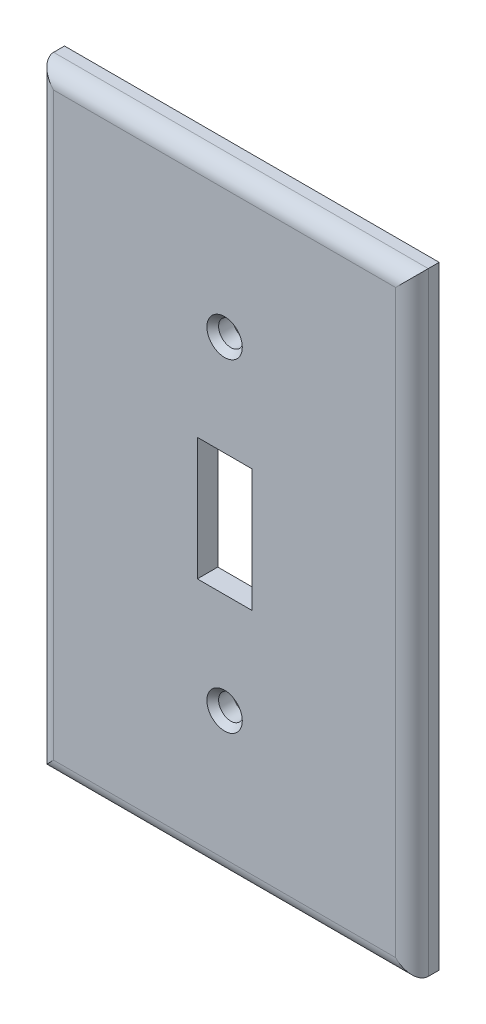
ISO-10303-21;
HEADER;
FILE_DESCRIPTION(('STEP AP214'),'2;1');
FILE_NAME('part.step','',(''),(''),'','','');
FILE_SCHEMA(('AUTOMOTIVE_DESIGN { 1 0 10303 214 1 1 1 1 }'));
ENDSEC;
DATA;
#1=APPLICATION_CONTEXT('core data for automotive mechanical design processes');
#2=APPLICATION_PROTOCOL_DEFINITION('international standard','automotive_design',2000,#1);
#3=PRODUCT_CONTEXT('',#1,'mechanical');
#4=PRODUCT('Part','Part','',(#3));
#5=PRODUCT_RELATED_PRODUCT_CATEGORY('part','',(#4));
#6=PRODUCT_DEFINITION_FORMATION('','',#4);
#7=PRODUCT_DEFINITION_CONTEXT('part definition',#1,'design');
#8=PRODUCT_DEFINITION('design','',#6,#7);
#9=PRODUCT_DEFINITION_SHAPE('','',#8);
#10=(LENGTH_UNIT() NAMED_UNIT(*) SI_UNIT(.MILLI.,.METRE.));
#11=(NAMED_UNIT(*) PLANE_ANGLE_UNIT() SI_UNIT($,.RADIAN.));
#12=(NAMED_UNIT(*) SI_UNIT($,.STERADIAN.) SOLID_ANGLE_UNIT());
#13=UNCERTAINTY_MEASURE_WITH_UNIT(LENGTH_MEASURE(1.E-05),#10,'distance_accuracy_value','');
#14=(GEOMETRIC_REPRESENTATION_CONTEXT(3) GLOBAL_UNCERTAINTY_ASSIGNED_CONTEXT((#13)) GLOBAL_UNIT_ASSIGNED_CONTEXT((#10,
#11,#12)) REPRESENTATION_CONTEXT('',''));
#15=CARTESIAN_POINT('',(0.,0.,0.));
#16=DIRECTION('',(0.,0.,1.));
#17=DIRECTION('',(1.,0.,0.));
#18=AXIS2_PLACEMENT_3D('',#15,#16,#17);
#19=CARTESIAN_POINT('',(-5.08,11.43,5.08));
#20=DIRECTION('',(1.,0.,0.));
#21=DIRECTION('',(0.,0.,-1.));
#22=AXIS2_PLACEMENT_3D('',#19,#20,#21);
#23=PLANE('',#22);
#24=DIRECTION('',(0.,0.,-1.));
#25=VECTOR('',#24,1.);
#26=CARTESIAN_POINT('',(-5.08,-11.43,5.08));
#27=LINE('',#26,#25);
#28=CARTESIAN_POINT('',(-5.08,-11.43,5.08));
#29=VERTEX_POINT('',#28);
#30=CARTESIAN_POINT('',(-5.08,-11.43,1.27));
#31=VERTEX_POINT('',#30);
#32=EDGE_CURVE('E284',#29,#31,#27,.T.);
#33=ORIENTED_EDGE('',*,*,#32,.T.);
#34=DIRECTION('',(0.,1.,0.));
#35=VECTOR('',#34,1.);
#36=CARTESIAN_POINT('',(-5.08,11.43,1.27));
#37=LINE('',#36,#35);
#38=CARTESIAN_POINT('',(-5.08,11.43,1.27));
#39=VERTEX_POINT('',#38);
#40=EDGE_CURVE('E235',#31,#39,#37,.T.);
#41=ORIENTED_EDGE('',*,*,#40,.T.);
#42=DIRECTION('',(0.,0.,-1.));
#43=VECTOR('',#42,1.);
#44=CARTESIAN_POINT('',(-5.08,11.43,5.08));
#45=LINE('',#44,#43);
#46=CARTESIAN_POINT('',(-5.08,11.43,5.08));
#47=VERTEX_POINT('',#46);
#48=EDGE_CURVE('E275',#47,#39,#45,.T.);
#49=ORIENTED_EDGE('',*,*,#48,.F.);
#50=DIRECTION('',(0.,-1.,0.));
#51=VECTOR('',#50,1.);
#52=CARTESIAN_POINT('',(-5.08,11.43,5.08));
#53=LINE('',#52,#51);
#54=EDGE_CURVE('E266',#47,#29,#53,.T.);
#55=ORIENTED_EDGE('',*,*,#54,.T.);
#56=EDGE_LOOP('',(#33,#41,#49,#55));
#57=FACE_BOUND('',#56,.T.);
#58=ADVANCED_FACE('F36',(#57),#23,.T.);
#59=CARTESIAN_POINT('',(-5.08,-11.43,5.08));
#60=DIRECTION('',(0.,1.,0.));
#61=DIRECTION('',(0.,0.,1.));
#62=AXIS2_PLACEMENT_3D('',#59,#60,#61);
#63=PLANE('',#62);
#64=DIRECTION('',(0.,0.,-1.));
#65=VECTOR('',#64,1.);
#66=CARTESIAN_POINT('',(5.08,-11.43,5.08));
#67=LINE('',#66,#65);
#68=CARTESIAN_POINT('',(5.08,-11.43,5.08));
#69=VERTEX_POINT('',#68);
#70=CARTESIAN_POINT('',(5.08,-11.43,1.27));
#71=VERTEX_POINT('',#70);
#72=EDGE_CURVE('E281',#69,#71,#67,.T.);
#73=ORIENTED_EDGE('',*,*,#72,.T.);
#74=DIRECTION('',(-1.,0.,0.));
#75=VECTOR('',#74,1.);
#76=CARTESIAN_POINT('',(-5.08,-11.43,1.27));
#77=LINE('',#76,#75);
#78=EDGE_CURVE('E386',#71,#31,#77,.T.);
#79=ORIENTED_EDGE('',*,*,#78,.T.);
#80=ORIENTED_EDGE('',*,*,#32,.F.);
#81=DIRECTION('',(1.,0.,0.));
#82=VECTOR('',#81,1.);
#83=CARTESIAN_POINT('',(-5.08,-11.43,5.08));
#84=LINE('',#83,#82);
#85=EDGE_CURVE('E268',#29,#69,#84,.T.);
#86=ORIENTED_EDGE('',*,*,#85,.T.);
#87=EDGE_LOOP('',(#73,#79,#80,#86));
#88=FACE_BOUND('',#87,.T.);
#89=ADVANCED_FACE('F382',(#88),#63,.T.);
#90=CARTESIAN_POINT('',(5.08,11.43,5.08));
#91=DIRECTION('',(-1.,0.,0.));
#92=DIRECTION('',(0.,0.,1.));
#93=AXIS2_PLACEMENT_3D('',#90,#91,#92);
#94=PLANE('',#93);
#95=DIRECTION('',(0.,0.,-1.));
#96=VECTOR('',#95,1.);
#97=CARTESIAN_POINT('',(5.08,11.43,5.08));
#98=LINE('',#97,#96);
#99=CARTESIAN_POINT('',(5.08,11.43,5.08));
#100=VERTEX_POINT('',#99);
#101=CARTESIAN_POINT('',(5.08,11.43,1.27));
#102=VERTEX_POINT('',#101);
#103=EDGE_CURVE('E278',#100,#102,#98,.T.);
#104=ORIENTED_EDGE('',*,*,#103,.T.);
#105=DIRECTION('',(0.,-1.,0.));
#106=VECTOR('',#105,1.);
#107=CARTESIAN_POINT('',(5.08,11.43,1.27));
#108=LINE('',#107,#106);
#109=EDGE_CURVE('E53',#102,#71,#108,.T.);
#110=ORIENTED_EDGE('',*,*,#109,.T.);
#111=ORIENTED_EDGE('',*,*,#72,.F.);
#112=DIRECTION('',(0.,1.,0.));
#113=VECTOR('',#112,1.);
#114=CARTESIAN_POINT('',(5.08,11.43,5.08));
#115=LINE('',#114,#113);
#116=EDGE_CURVE('E270',#69,#100,#115,.T.);
#117=ORIENTED_EDGE('',*,*,#116,.T.);
#118=EDGE_LOOP('',(#104,#110,#111,#117));
#119=FACE_BOUND('',#118,.T.);
#120=ADVANCED_FACE('F385',(#119),#94,.T.);
#121=CARTESIAN_POINT('',(-5.08,11.43,5.08));
#122=DIRECTION('',(0.,-1.,0.));
#123=DIRECTION('',(0.,0.,-1.));
#124=AXIS2_PLACEMENT_3D('',#121,#122,#123);
#125=PLANE('',#124);
#126=ORIENTED_EDGE('',*,*,#48,.T.);
#127=DIRECTION('',(1.,0.,0.));
#128=VECTOR('',#127,1.);
#129=CARTESIAN_POINT('',(-5.08,11.43,1.27));
#130=LINE('',#129,#128);
#131=EDGE_CURVE('E387',#39,#102,#130,.T.);
#132=ORIENTED_EDGE('',*,*,#131,.T.);
#133=ORIENTED_EDGE('',*,*,#103,.F.);
#134=DIRECTION('',(-1.,0.,0.));
#135=VECTOR('',#134,1.);
#136=CARTESIAN_POINT('',(-5.08,11.43,5.08));
#137=LINE('',#136,#135);
#138=EDGE_CURVE('E273',#100,#47,#137,.T.);
#139=ORIENTED_EDGE('',*,*,#138,.T.);
#140=EDGE_LOOP('',(#126,#132,#133,#139));
#141=FACE_BOUND('',#140,.T.);
#142=ADVANCED_FACE('F432',(#141),#125,.T.);
#143=CARTESIAN_POINT('',(0.,-30.1625,5.08));
#144=DIRECTION('',(0.,0.,1.));
#145=DIRECTION('',(1.,0.,0.));
#146=AXIS2_PLACEMENT_3D('',#143,#144,#145);
#147=CYLINDRICAL_SURFACE('',#146,2.286);
#148=CARTESIAN_POINT('',(0.,-30.1625,3.91122569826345));
#149=DIRECTION('',(0.,0.,1.));
#150=DIRECTION('',(1.,0.,0.));
#151=AXIS2_PLACEMENT_3D('',#148,#149,#150);
#152=CIRCLE('',#151,2.286);
#153=CARTESIAN_POINT('',(2.286,-30.1625,3.91122569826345));
#154=VERTEX_POINT('',#153);
#155=EDGE_CURVE('E263',#154,#154,#152,.T.);
#156=ORIENTED_EDGE('',*,*,#155,.T.);
#157=EDGE_LOOP('',(#156));
#158=FACE_BOUND('',#157,.T.);
#159=CARTESIAN_POINT('',(0.,-30.1625,1.27));
#160=DIRECTION('',(0.,0.,-1.));
#161=DIRECTION('',(-1.,0.,0.));
#162=AXIS2_PLACEMENT_3D('',#159,#160,#161);
#163=CIRCLE('',#162,2.286);
#164=CARTESIAN_POINT('',(-2.286,-30.1625,1.27));
#165=VERTEX_POINT('',#164);
#166=EDGE_CURVE('E390',#165,#165,#163,.F.);
#167=ORIENTED_EDGE('',*,*,#166,.F.);
#168=EDGE_LOOP('',(#167));
#169=FACE_BOUND('',#168,.T.);
#170=ADVANCED_FACE('F429',(#158,#169),#147,.F.);
#171=CARTESIAN_POINT('',(0.,30.1625,5.08));
#172=DIRECTION('',(0.,0.,1.));
#173=DIRECTION('',(1.,0.,0.));
#174=AXIS2_PLACEMENT_3D('',#171,#172,#173);
#175=CYLINDRICAL_SURFACE('',#174,2.286);
#176=CARTESIAN_POINT('',(0.,30.1625,3.91122569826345));
#177=DIRECTION('',(0.,0.,1.));
#178=DIRECTION('',(1.,0.,0.));
#179=AXIS2_PLACEMENT_3D('',#176,#177,#178);
#180=CIRCLE('',#179,2.286);
#181=CARTESIAN_POINT('',(2.286,30.1625,3.91122569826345));
#182=VERTEX_POINT('',#181);
#183=EDGE_CURVE('E256',#182,#182,#180,.T.);
#184=ORIENTED_EDGE('',*,*,#183,.T.);
#185=EDGE_LOOP('',(#184));
#186=FACE_BOUND('',#185,.T.);
#187=CARTESIAN_POINT('',(0.,30.1625,1.27));
#188=DIRECTION('',(0.,0.,-1.));
#189=DIRECTION('',(-1.,0.,0.));
#190=AXIS2_PLACEMENT_3D('',#187,#188,#189);
#191=CIRCLE('',#190,2.286);
#192=CARTESIAN_POINT('',(-2.286,30.1625,1.27));
#193=VERTEX_POINT('',#192);
#194=EDGE_CURVE('E422',#193,#193,#191,.F.);
#195=ORIENTED_EDGE('',*,*,#194,.F.);
#196=EDGE_LOOP('',(#195));
#197=FACE_BOUND('',#196,.T.);
#198=ADVANCED_FACE('F431',(#186,#197),#175,.F.);
#199=CARTESIAN_POINT('',(-7.62,11.43,5.08));
#200=DIRECTION('',(1.,0.,0.));
#201=DIRECTION('',(0.,0.,-1.));
#202=AXIS2_PLACEMENT_3D('',#199,#200,#201);
#203=PLANE('',#202);
#204=DIRECTION('',(0.,1.,0.));
#205=VECTOR('',#204,1.);
#206=CARTESIAN_POINT('',(-7.61999999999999,34.9885,1.27));
#207=LINE('',#206,#205);
#208=CARTESIAN_POINT('',(-7.61999999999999,-13.97,1.27));
#209=VERTEX_POINT('',#208);
#210=CARTESIAN_POINT('',(-7.62,13.97,1.27));
#211=VERTEX_POINT('',#210);
#212=EDGE_CURVE('E61',#209,#211,#207,.T.);
#213=ORIENTED_EDGE('',*,*,#212,.F.);
#214=DIRECTION('',(0.,0.,-1.));
#215=VECTOR('',#214,1.);
#216=CARTESIAN_POINT('',(-7.62,-13.97,5.08));
#217=LINE('',#216,#215);
#218=CARTESIAN_POINT('',(-7.62,-13.97,2.54));
#219=VERTEX_POINT('',#218);
#220=EDGE_CURVE('E197',#219,#209,#217,.T.);
#221=ORIENTED_EDGE('',*,*,#220,.F.);
#222=DIRECTION('',(0.,-1.,0.));
#223=VECTOR('',#222,1.);
#224=CARTESIAN_POINT('',(-7.62,11.43,2.54));
#225=LINE('',#224,#223);
#226=CARTESIAN_POINT('',(-7.62,13.97,2.54));
#227=VERTEX_POINT('',#226);
#228=EDGE_CURVE('E213',#227,#219,#225,.T.);
#229=ORIENTED_EDGE('',*,*,#228,.F.);
#230=DIRECTION('',(0.,0.,-1.));
#231=VECTOR('',#230,1.);
#232=CARTESIAN_POINT('',(-7.62,13.97,5.08));
#233=LINE('',#232,#231);
#234=EDGE_CURVE('E195',#227,#211,#233,.T.);
#235=ORIENTED_EDGE('',*,*,#234,.T.);
#236=EDGE_LOOP('',(#213,#221,#229,#235));
#237=FACE_BOUND('',#236,.T.);
#238=ADVANCED_FACE('F415',(#237),#203,.F.);
#239=CARTESIAN_POINT('',(-5.08,-13.97,5.08));
#240=DIRECTION('',(0.,1.,0.));
#241=DIRECTION('',(0.,0.,1.));
#242=AXIS2_PLACEMENT_3D('',#239,#240,#241);
#243=PLANE('',#242);
#244=DIRECTION('',(-1.,0.,0.));
#245=VECTOR('',#244,1.);
#246=CARTESIAN_POINT('',(-5.08,-13.97,1.27));
#247=LINE('',#246,#245);
#248=CARTESIAN_POINT('',(7.61999999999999,-13.97,1.27));
#249=VERTEX_POINT('',#248);
#250=EDGE_CURVE('E180',#249,#209,#247,.T.);
#251=ORIENTED_EDGE('',*,*,#250,.F.);
#252=DIRECTION('',(0.,0.,-1.));
#253=VECTOR('',#252,1.);
#254=CARTESIAN_POINT('',(7.62,-13.97,5.08));
#255=LINE('',#254,#253);
#256=CARTESIAN_POINT('',(7.62,-13.97,2.54));
#257=VERTEX_POINT('',#256);
#258=EDGE_CURVE('E190',#257,#249,#255,.T.);
#259=ORIENTED_EDGE('',*,*,#258,.F.);
#260=DIRECTION('',(1.,0.,0.));
#261=VECTOR('',#260,1.);
#262=CARTESIAN_POINT('',(-5.08,-13.97,2.54));
#263=LINE('',#262,#261);
#264=EDGE_CURVE('E403',#219,#257,#263,.T.);
#265=ORIENTED_EDGE('',*,*,#264,.F.);
#266=ORIENTED_EDGE('',*,*,#220,.T.);
#267=EDGE_LOOP('',(#251,#259,#265,#266));
#268=FACE_BOUND('',#267,.T.);
#269=ADVANCED_FACE('F412',(#268),#243,.F.);
#270=CARTESIAN_POINT('',(7.62,11.43,5.08));
#271=DIRECTION('',(-1.,0.,0.));
#272=DIRECTION('',(0.,0.,1.));
#273=AXIS2_PLACEMENT_3D('',#270,#271,#272);
#274=PLANE('',#273);
#275=DIRECTION('',(0.,-1.,0.));
#276=VECTOR('',#275,1.);
#277=CARTESIAN_POINT('',(7.61999999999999,34.9885,1.27));
#278=LINE('',#277,#276);
#279=CARTESIAN_POINT('',(7.61999999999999,13.97,1.27));
#280=VERTEX_POINT('',#279);
#281=EDGE_CURVE('E174',#280,#249,#278,.T.);
#282=ORIENTED_EDGE('',*,*,#281,.F.);
#283=DIRECTION('',(0.,0.,-1.));
#284=VECTOR('',#283,1.);
#285=CARTESIAN_POINT('',(7.62,13.97,5.08));
#286=LINE('',#285,#284);
#287=CARTESIAN_POINT('',(7.62,13.97,2.54));
#288=VERTEX_POINT('',#287);
#289=EDGE_CURVE('E187',#288,#280,#286,.T.);
#290=ORIENTED_EDGE('',*,*,#289,.F.);
#291=DIRECTION('',(0.,1.,0.));
#292=VECTOR('',#291,1.);
#293=CARTESIAN_POINT('',(7.62,11.43,2.54));
#294=LINE('',#293,#292);
#295=EDGE_CURVE('E405',#257,#288,#294,.T.);
#296=ORIENTED_EDGE('',*,*,#295,.F.);
#297=ORIENTED_EDGE('',*,*,#258,.T.);
#298=EDGE_LOOP('',(#282,#290,#296,#297));
#299=FACE_BOUND('',#298,.T.);
#300=ADVANCED_FACE('F185',(#299),#274,.F.);
#301=CARTESIAN_POINT('',(-5.08,13.97,5.08));
#302=DIRECTION('',(0.,-1.,0.));
#303=DIRECTION('',(0.,0.,-1.));
#304=AXIS2_PLACEMENT_3D('',#301,#302,#303);
#305=PLANE('',#304);
#306=DIRECTION('',(1.,0.,0.));
#307=VECTOR('',#306,1.);
#308=CARTESIAN_POINT('',(-5.08,13.97,1.27));
#309=LINE('',#308,#307);
#310=EDGE_CURVE('E171',#211,#280,#309,.T.);
#311=ORIENTED_EDGE('',*,*,#310,.F.);
#312=ORIENTED_EDGE('',*,*,#234,.F.);
#313=DIRECTION('',(-1.,0.,0.));
#314=VECTOR('',#313,1.);
#315=CARTESIAN_POINT('',(-5.08,13.97,2.54));
#316=LINE('',#315,#314);
#317=EDGE_CURVE('E194',#288,#227,#316,.T.);
#318=ORIENTED_EDGE('',*,*,#317,.F.);
#319=ORIENTED_EDGE('',*,*,#289,.T.);
#320=EDGE_LOOP('',(#311,#312,#318,#319));
#321=FACE_BOUND('',#320,.T.);
#322=ADVANCED_FACE('F193',(#321),#305,.F.);
#323=CARTESIAN_POINT('',(0.,-30.1625,5.08));
#324=DIRECTION('',(0.,0.,1.));
#325=DIRECTION('',(1.,0.,0.));
#326=AXIS2_PLACEMENT_3D('',#323,#324,#325);
#327=CYLINDRICAL_SURFACE('',#326,4.826);
#328=CARTESIAN_POINT('',(0.,-30.1625,2.54));
#329=DIRECTION('',(0.,0.,1.));
#330=DIRECTION('',(1.,0.,0.));
#331=AXIS2_PLACEMENT_3D('',#328,#329,#330);
#332=CIRCLE('',#331,4.826);
#333=CARTESIAN_POINT('',(4.826,-30.1625,2.54));
#334=VERTEX_POINT('',#333);
#335=EDGE_CURVE('E219',#334,#334,#332,.F.);
#336=ORIENTED_EDGE('',*,*,#335,.T.);
#337=EDGE_LOOP('',(#336));
#338=FACE_BOUND('',#337,.T.);
#339=CARTESIAN_POINT('',(0.,-30.1625,1.27));
#340=DIRECTION('',(0.,0.,-1.));
#341=DIRECTION('',(-1.,0.,0.));
#342=AXIS2_PLACEMENT_3D('',#339,#340,#341);
#343=CIRCLE('',#342,4.826);
#344=CARTESIAN_POINT('',(-4.826,-30.1625,1.27));
#345=VERTEX_POINT('',#344);
#346=EDGE_CURVE('E181',#345,#345,#343,.F.);
#347=ORIENTED_EDGE('',*,*,#346,.T.);
#348=EDGE_LOOP('',(#347));
#349=FACE_BOUND('',#348,.T.);
#350=ADVANCED_FACE('F506',(#338,#349),#327,.T.);
#351=CARTESIAN_POINT('',(0.,30.1625,5.08));
#352=DIRECTION('',(0.,0.,1.));
#353=DIRECTION('',(1.,0.,0.));
#354=AXIS2_PLACEMENT_3D('',#351,#352,#353);
#355=CYLINDRICAL_SURFACE('',#354,4.826);
#356=CARTESIAN_POINT('',(0.,30.1625,2.54));
#357=DIRECTION('',(0.,0.,1.));
#358=DIRECTION('',(1.,0.,0.));
#359=AXIS2_PLACEMENT_3D('',#356,#357,#358);
#360=CIRCLE('',#359,4.826);
#361=CARTESIAN_POINT('',(4.826,30.1625,2.54));
#362=VERTEX_POINT('',#361);
#363=EDGE_CURVE('E249',#362,#362,#360,.F.);
#364=ORIENTED_EDGE('',*,*,#363,.T.);
#365=EDGE_LOOP('',(#364));
#366=FACE_BOUND('',#365,.T.);
#367=CARTESIAN_POINT('',(0.,30.1625,1.27));
#368=DIRECTION('',(0.,0.,-1.));
#369=DIRECTION('',(-1.,0.,0.));
#370=AXIS2_PLACEMENT_3D('',#367,#368,#369);
#371=CIRCLE('',#370,4.826);
#372=CARTESIAN_POINT('',(-4.826,30.1625,1.27));
#373=VERTEX_POINT('',#372);
#374=EDGE_CURVE('E40',#373,#373,#371,.F.);
#375=ORIENTED_EDGE('',*,*,#374,.T.);
#376=EDGE_LOOP('',(#375));
#377=FACE_BOUND('',#376,.T.);
#378=ADVANCED_FACE('F369',(#366,#377),#355,.T.);
#379=CARTESIAN_POINT('',(0.,0.,5.08));
#380=DIRECTION('',(0.,0.,1.));
#381=DIRECTION('',(1.,0.,0.));
#382=AXIS2_PLACEMENT_3D('',#379,#380,#381);
#383=PLANE('',#382);
#384=DIRECTION('',(0.,1.,0.));
#385=VECTOR('',#384,1.);
#386=CARTESIAN_POINT('',(31.877,57.15,5.08));
#387=LINE('',#386,#385);
#388=CARTESIAN_POINT('',(31.877,-54.102,5.08));
#389=VERTEX_POINT('',#388);
#390=CARTESIAN_POINT('',(31.877,54.102,5.08));
#391=VERTEX_POINT('',#390);
#392=EDGE_CURVE('E311',#389,#391,#387,.T.);
#393=ORIENTED_EDGE('',*,*,#392,.T.);
#394=DIRECTION('',(-1.,0.,0.));
#395=VECTOR('',#394,1.);
#396=CARTESIAN_POINT('',(-34.925,54.102,5.08));
#397=LINE('',#396,#395);
#398=CARTESIAN_POINT('',(-31.877,54.102,5.08));
#399=VERTEX_POINT('',#398);
#400=EDGE_CURVE('E313',#391,#399,#397,.T.);
#401=ORIENTED_EDGE('',*,*,#400,.T.);
#402=DIRECTION('',(0.,-1.,0.));
#403=VECTOR('',#402,1.);
#404=CARTESIAN_POINT('',(-31.877,-57.15,5.08));
#405=LINE('',#404,#403);
#406=CARTESIAN_POINT('',(-31.877,-54.102,5.08));
#407=VERTEX_POINT('',#406);
#408=EDGE_CURVE('E307',#399,#407,#405,.T.);
#409=ORIENTED_EDGE('',*,*,#408,.T.);
#410=DIRECTION('',(1.,0.,0.));
#411=VECTOR('',#410,1.);
#412=CARTESIAN_POINT('',(34.925,-54.102,5.08));
#413=LINE('',#412,#411);
#414=EDGE_CURVE('E309',#407,#389,#413,.T.);
#415=ORIENTED_EDGE('',*,*,#414,.T.);
#416=EDGE_LOOP('',(#393,#401,#409,#415));
#417=FACE_BOUND('',#416,.T.);
#418=CARTESIAN_POINT('',(0.,30.1625,5.08));
#419=DIRECTION('',(0.,0.,1.));
#420=DIRECTION('',(1.,0.,0.));
#421=AXIS2_PLACEMENT_3D('',#418,#419,#420);
#422=CIRCLE('',#421,3.302);
#423=CARTESIAN_POINT('',(3.302,30.1625,5.08));
#424=VERTEX_POINT('',#423);
#425=EDGE_CURVE('E253',#424,#424,#422,.T.);
#426=ORIENTED_EDGE('',*,*,#425,.F.);
#427=EDGE_LOOP('',(#426));
#428=FACE_BOUND('',#427,.T.);
#429=CARTESIAN_POINT('',(0.,-30.1625,5.08));
#430=DIRECTION('',(0.,0.,1.));
#431=DIRECTION('',(1.,0.,0.));
#432=AXIS2_PLACEMENT_3D('',#429,#430,#431);
#433=CIRCLE('',#432,3.302);
#434=CARTESIAN_POINT('',(3.302,-30.1625,5.08));
#435=VERTEX_POINT('',#434);
#436=EDGE_CURVE('E260',#435,#435,#433,.T.);
#437=ORIENTED_EDGE('',*,*,#436,.F.);
#438=EDGE_LOOP('',(#437));
#439=FACE_BOUND('',#438,.T.);
#440=ORIENTED_EDGE('',*,*,#85,.F.);
#441=ORIENTED_EDGE('',*,*,#54,.F.);
#442=ORIENTED_EDGE('',*,*,#138,.F.);
#443=ORIENTED_EDGE('',*,*,#116,.F.);
#444=EDGE_LOOP('',(#440,#441,#442,#443));
#445=FACE_BOUND('',#444,.T.);
#446=ADVANCED_FACE('F366',(#417,#428,#439,#445),#383,.T.);
#447=CARTESIAN_POINT('',(0.,0.,0.));
#448=DIRECTION('',(0.,0.,1.));
#449=DIRECTION('',(1.,0.,0.));
#450=AXIS2_PLACEMENT_3D('',#447,#448,#449);
#451=PLANE('',#450);
#452=DIRECTION('',(-1.,0.,0.));
#453=VECTOR('',#452,1.);
#454=CARTESIAN_POINT('',(-34.925,54.61,0.));
#455=LINE('',#454,#453);
#456=CARTESIAN_POINT('',(32.385,54.61,0.));
#457=VERTEX_POINT('',#456);
#458=CARTESIAN_POINT('',(-32.385,54.61,0.));
#459=VERTEX_POINT('',#458);
#460=EDGE_CURVE('E223',#457,#459,#455,.T.);
#461=ORIENTED_EDGE('',*,*,#460,.T.);
#462=DIRECTION('',(0.,-1.,0.));
#463=VECTOR('',#462,1.);
#464=CARTESIAN_POINT('',(-32.385,57.15,0.));
#465=LINE('',#464,#463);
#466=CARTESIAN_POINT('',(-32.385,-54.61,0.));
#467=VERTEX_POINT('',#466);
#468=EDGE_CURVE('E236',#459,#467,#465,.T.);
#469=ORIENTED_EDGE('',*,*,#468,.T.);
#470=DIRECTION('',(1.,0.,0.));
#471=VECTOR('',#470,1.);
#472=CARTESIAN_POINT('',(-34.925,-54.61,0.));
#473=LINE('',#472,#471);
#474=CARTESIAN_POINT('',(32.385,-54.61,0.));
#475=VERTEX_POINT('',#474);
#476=EDGE_CURVE('E239',#467,#475,#473,.T.);
#477=ORIENTED_EDGE('',*,*,#476,.T.);
#478=DIRECTION('',(0.,1.,0.));
#479=VECTOR('',#478,1.);
#480=CARTESIAN_POINT('',(32.385,57.15,0.));
#481=LINE('',#480,#479);
#482=EDGE_CURVE('E242',#475,#457,#481,.T.);
#483=ORIENTED_EDGE('',*,*,#482,.T.);
#484=EDGE_LOOP('',(#461,#469,#477,#483));
#485=FACE_BOUND('',#484,.T.);
#486=DIRECTION('',(0.,-1.,0.));
#487=VECTOR('',#486,1.);
#488=CARTESIAN_POINT('',(-34.925,57.15,0.));
#489=LINE('',#488,#487);
#490=CARTESIAN_POINT('',(-34.925,57.15,0.));
#491=VERTEX_POINT('',#490);
#492=CARTESIAN_POINT('',(-34.925,-57.15,0.));
#493=VERTEX_POINT('',#492);
#494=EDGE_CURVE('E287',#491,#493,#489,.T.);
#495=ORIENTED_EDGE('',*,*,#494,.F.);
#496=DIRECTION('',(-1.,0.,0.));
#497=VECTOR('',#496,1.);
#498=CARTESIAN_POINT('',(-34.925,57.15,0.));
#499=LINE('',#498,#497);
#500=CARTESIAN_POINT('',(34.925,57.15,0.));
#501=VERTEX_POINT('',#500);
#502=EDGE_CURVE('E296',#501,#491,#499,.T.);
#503=ORIENTED_EDGE('',*,*,#502,.F.);
#504=DIRECTION('',(0.,1.,0.));
#505=VECTOR('',#504,1.);
#506=CARTESIAN_POINT('',(34.925,57.15,0.));
#507=LINE('',#506,#505);
#508=CARTESIAN_POINT('',(34.925,-57.15,0.));
#509=VERTEX_POINT('',#508);
#510=EDGE_CURVE('E293',#509,#501,#507,.T.);
#511=ORIENTED_EDGE('',*,*,#510,.F.);
#512=DIRECTION('',(1.,0.,0.));
#513=VECTOR('',#512,1.);
#514=CARTESIAN_POINT('',(-34.925,-57.15,0.));
#515=LINE('',#514,#513);
#516=EDGE_CURVE('E290',#493,#509,#515,.T.);
#517=ORIENTED_EDGE('',*,*,#516,.F.);
#518=EDGE_LOOP('',(#495,#503,#511,#517));
#519=FACE_BOUND('',#518,.T.);
#520=ADVANCED_FACE('F350',(#485,#519),#451,.F.);
#521=CARTESIAN_POINT('',(-34.925,57.15,5.08));
#522=DIRECTION('',(1.,0.,0.));
#523=DIRECTION('',(0.,0.,-1.));
#524=AXIS2_PLACEMENT_3D('',#521,#522,#523);
#525=PLANE('',#524);
#526=DIRECTION('',(0.,0.,-1.));
#527=VECTOR('',#526,1.);
#528=CARTESIAN_POINT('',(-34.925,-57.15,5.08));
#529=LINE('',#528,#527);
#530=CARTESIAN_POINT('',(-34.925,-57.15,2.032));
#531=VERTEX_POINT('',#530);
#532=EDGE_CURVE('E305',#531,#493,#529,.T.);
#533=ORIENTED_EDGE('',*,*,#532,.F.);
#534=DIRECTION('',(0.,-1.,0.));
#535=VECTOR('',#534,1.);
#536=CARTESIAN_POINT('',(-34.925,57.15,2.032));
#537=LINE('',#536,#535);
#538=CARTESIAN_POINT('',(-34.925,57.15,2.032));
#539=VERTEX_POINT('',#538);
#540=EDGE_CURVE('E11',#531,#539,#537,.F.);
#541=ORIENTED_EDGE('',*,*,#540,.T.);
#542=DIRECTION('',(0.,0.,-1.));
#543=VECTOR('',#542,1.);
#544=CARTESIAN_POINT('',(-34.925,57.15,5.08));
#545=LINE('',#544,#543);
#546=EDGE_CURVE('E299',#539,#491,#545,.T.);
#547=ORIENTED_EDGE('',*,*,#546,.T.);
#548=ORIENTED_EDGE('',*,*,#494,.T.);
#549=EDGE_LOOP('',(#533,#541,#547,#548));
#550=FACE_BOUND('',#549,.T.);
#551=ADVANCED_FACE('F345',(#550),#525,.F.);
#552=CARTESIAN_POINT('',(-34.925,-57.15,5.08));
#553=DIRECTION('',(0.,1.,0.));
#554=DIRECTION('',(0.,0.,1.));
#555=AXIS2_PLACEMENT_3D('',#552,#553,#554);
#556=PLANE('',#555);
#557=DIRECTION('',(0.,0.,-1.));
#558=VECTOR('',#557,1.);
#559=CARTESIAN_POINT('',(34.925,-57.15,5.08));
#560=LINE('',#559,#558);
#561=CARTESIAN_POINT('',(34.925,-57.15,2.032));
#562=VERTEX_POINT('',#561);
#563=EDGE_CURVE('E303',#562,#509,#560,.T.);
#564=ORIENTED_EDGE('',*,*,#563,.F.);
#565=DIRECTION('',(1.,0.,0.));
#566=VECTOR('',#565,1.);
#567=CARTESIAN_POINT('',(-34.925,-57.15,2.032));
#568=LINE('',#567,#566);
#569=EDGE_CURVE('E45',#562,#531,#568,.F.);
#570=ORIENTED_EDGE('',*,*,#569,.T.);
#571=ORIENTED_EDGE('',*,*,#532,.T.);
#572=ORIENTED_EDGE('',*,*,#516,.T.);
#573=EDGE_LOOP('',(#564,#570,#571,#572));
#574=FACE_BOUND('',#573,.T.);
#575=ADVANCED_FACE('F342',(#574),#556,.F.);
#576=CARTESIAN_POINT('',(34.925,57.15,5.08));
#577=DIRECTION('',(-1.,0.,0.));
#578=DIRECTION('',(0.,0.,1.));
#579=AXIS2_PLACEMENT_3D('',#576,#577,#578);
#580=PLANE('',#579);
#581=DIRECTION('',(0.,0.,-1.));
#582=VECTOR('',#581,1.);
#583=CARTESIAN_POINT('',(34.925,57.15,5.08));
#584=LINE('',#583,#582);
#585=CARTESIAN_POINT('',(34.925,57.15,2.032));
#586=VERTEX_POINT('',#585);
#587=EDGE_CURVE('E301',#586,#501,#584,.T.);
#588=ORIENTED_EDGE('',*,*,#587,.F.);
#589=DIRECTION('',(0.,1.,0.));
#590=VECTOR('',#589,1.);
#591=CARTESIAN_POINT('',(34.925,-57.15,2.032));
#592=LINE('',#591,#590);
#593=EDGE_CURVE('E319',#586,#562,#592,.F.);
#594=ORIENTED_EDGE('',*,*,#593,.T.);
#595=ORIENTED_EDGE('',*,*,#563,.T.);
#596=ORIENTED_EDGE('',*,*,#510,.T.);
#597=EDGE_LOOP('',(#588,#594,#595,#596));
#598=FACE_BOUND('',#597,.T.);
#599=ADVANCED_FACE('F354',(#598),#580,.F.);
#600=CARTESIAN_POINT('',(-34.925,57.15,5.08));
#601=DIRECTION('',(0.,-1.,0.));
#602=DIRECTION('',(0.,0.,-1.));
#603=AXIS2_PLACEMENT_3D('',#600,#601,#602);
#604=PLANE('',#603);
#605=ORIENTED_EDGE('',*,*,#546,.F.);
#606=DIRECTION('',(-1.,0.,0.));
#607=VECTOR('',#606,1.);
#608=CARTESIAN_POINT('',(34.925,57.15,2.032));
#609=LINE('',#608,#607);
#610=EDGE_CURVE('E316',#539,#586,#609,.F.);
#611=ORIENTED_EDGE('',*,*,#610,.T.);
#612=ORIENTED_EDGE('',*,*,#587,.T.);
#613=ORIENTED_EDGE('',*,*,#502,.T.);
#614=EDGE_LOOP('',(#605,#611,#612,#613));
#615=FACE_BOUND('',#614,.T.);
#616=ADVANCED_FACE('F356',(#615),#604,.F.);
#617=CARTESIAN_POINT('',(0.,-30.1625,5.08));
#618=DIRECTION('',(0.,0.,1.));
#619=DIRECTION('',(1.,0.,0.));
#620=AXIS2_PLACEMENT_3D('',#617,#618,#619);
#621=CONICAL_SURFACE('',#620,3.302,0.715584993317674);
#622=ORIENTED_EDGE('',*,*,#155,.F.);
#623=EDGE_LOOP('',(#622));
#624=FACE_BOUND('',#623,.T.);
#625=ORIENTED_EDGE('',*,*,#436,.T.);
#626=EDGE_LOOP('',(#625));
#627=FACE_BOUND('',#626,.T.);
#628=ADVANCED_FACE('F458',(#624,#627),#621,.F.);
#629=CARTESIAN_POINT('',(0.,30.1625,5.08));
#630=DIRECTION('',(0.,0.,1.));
#631=DIRECTION('',(1.,0.,0.));
#632=AXIS2_PLACEMENT_3D('',#629,#630,#631);
#633=CONICAL_SURFACE('',#632,3.302,0.715584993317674);
#634=ORIENTED_EDGE('',*,*,#183,.F.);
#635=EDGE_LOOP('',(#634));
#636=FACE_BOUND('',#635,.T.);
#637=ORIENTED_EDGE('',*,*,#425,.T.);
#638=EDGE_LOOP('',(#637));
#639=FACE_BOUND('',#638,.T.);
#640=ADVANCED_FACE('F473',(#636,#639),#633,.F.);
#641=CARTESIAN_POINT('',(0.,-54.102,2.032));
#642=DIRECTION('',(-1.,0.,0.));
#643=DIRECTION('',(0.,0.,1.));
#644=AXIS2_PLACEMENT_3D('',#641,#642,#643);
#645=CYLINDRICAL_SURFACE('',#644,3.048);
#646=CARTESIAN_POINT('',(-31.877,-54.102,2.032));
#647=DIRECTION('',(-0.707106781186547,0.707106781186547,0.));
#648=DIRECTION('',(0.707106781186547,0.707106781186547,0.));
#649=AXIS2_PLACEMENT_3D('',#646,#647,#648);
#650=ELLIPSE('',#649,4.31052293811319,3.048);
#651=EDGE_CURVE('E325',#531,#407,#650,.T.);
#652=ORIENTED_EDGE('',*,*,#651,.F.);
#653=ORIENTED_EDGE('',*,*,#569,.F.);
#654=CARTESIAN_POINT('',(31.877,-54.102,2.032));
#655=DIRECTION('',(-0.707106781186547,-0.707106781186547,0.));
#656=DIRECTION('',(-0.707106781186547,0.707106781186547,0.));
#657=AXIS2_PLACEMENT_3D('',#654,#655,#656);
#658=ELLIPSE('',#657,4.31052293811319,3.048);
#659=EDGE_CURVE('E257',#389,#562,#658,.F.);
#660=ORIENTED_EDGE('',*,*,#659,.F.);
#661=ORIENTED_EDGE('',*,*,#414,.F.);
#662=EDGE_LOOP('',(#652,#653,#660,#661));
#663=FACE_BOUND('',#662,.T.);
#664=ADVANCED_FACE('F38',(#663),#645,.T.);
#665=CARTESIAN_POINT('',(31.877,0.,2.032));
#666=DIRECTION('',(0.,-1.,0.));
#667=DIRECTION('',(0.,0.,-1.));
#668=AXIS2_PLACEMENT_3D('',#665,#666,#667);
#669=CYLINDRICAL_SURFACE('',#668,3.048);
#670=ORIENTED_EDGE('',*,*,#659,.T.);
#671=ORIENTED_EDGE('',*,*,#593,.F.);
#672=CARTESIAN_POINT('',(31.877,54.102,2.032));
#673=DIRECTION('',(0.707106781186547,-0.707106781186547,0.));
#674=DIRECTION('',(-0.707106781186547,-0.707106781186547,0.));
#675=AXIS2_PLACEMENT_3D('',#672,#673,#674);
#676=ELLIPSE('',#675,4.31052293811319,3.048);
#677=EDGE_CURVE('E323',#391,#586,#676,.F.);
#678=ORIENTED_EDGE('',*,*,#677,.F.);
#679=ORIENTED_EDGE('',*,*,#392,.F.);
#680=EDGE_LOOP('',(#670,#671,#678,#679));
#681=FACE_BOUND('',#680,.T.);
#682=ADVANCED_FACE('F332',(#681),#669,.T.);
#683=CARTESIAN_POINT('',(-31.877,0.,2.032));
#684=DIRECTION('',(0.,1.,0.));
#685=DIRECTION('',(0.,0.,1.));
#686=AXIS2_PLACEMENT_3D('',#683,#684,#685);
#687=CYLINDRICAL_SURFACE('',#686,3.048);
#688=ORIENTED_EDGE('',*,*,#651,.T.);
#689=ORIENTED_EDGE('',*,*,#408,.F.);
#690=CARTESIAN_POINT('',(-31.877,54.102,2.032));
#691=DIRECTION('',(0.707106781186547,0.707106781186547,0.));
#692=DIRECTION('',(-0.707106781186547,0.707106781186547,0.));
#693=AXIS2_PLACEMENT_3D('',#690,#691,#692);
#694=ELLIPSE('',#693,4.31052293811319,3.048);
#695=EDGE_CURVE('E252',#539,#399,#694,.T.);
#696=ORIENTED_EDGE('',*,*,#695,.F.);
#697=ORIENTED_EDGE('',*,*,#540,.F.);
#698=EDGE_LOOP('',(#688,#689,#696,#697));
#699=FACE_BOUND('',#698,.T.);
#700=ADVANCED_FACE('F364',(#699),#687,.T.);
#701=CARTESIAN_POINT('',(0.,54.102,2.032));
#702=DIRECTION('',(1.,0.,0.));
#703=DIRECTION('',(0.,0.,-1.));
#704=AXIS2_PLACEMENT_3D('',#701,#702,#703);
#705=CYLINDRICAL_SURFACE('',#704,3.048);
#706=ORIENTED_EDGE('',*,*,#677,.T.);
#707=ORIENTED_EDGE('',*,*,#610,.F.);
#708=ORIENTED_EDGE('',*,*,#695,.T.);
#709=ORIENTED_EDGE('',*,*,#400,.F.);
#710=EDGE_LOOP('',(#706,#707,#708,#709));
#711=FACE_BOUND('',#710,.T.);
#712=ADVANCED_FACE('F360',(#711),#705,.T.);
#713=CARTESIAN_POINT('',(0.,0.,2.54));
#714=DIRECTION('',(0.,0.,1.));
#715=DIRECTION('',(1.,0.,0.));
#716=AXIS2_PLACEMENT_3D('',#713,#714,#715);
#717=PLANE('',#716);
#718=ORIENTED_EDGE('',*,*,#335,.F.);
#719=EDGE_LOOP('',(#718));
#720=FACE_BOUND('',#719,.T.);
#721=DIRECTION('',(0.,1.,0.));
#722=VECTOR('',#721,1.);
#723=CARTESIAN_POINT('',(31.877,0.,2.54));
#724=LINE('',#723,#722);
#725=CARTESIAN_POINT('',(31.877,-54.102,2.54));
#726=VERTEX_POINT('',#725);
#727=CARTESIAN_POINT('',(31.877,54.102,2.54));
#728=VERTEX_POINT('',#727);
#729=EDGE_CURVE('E396',#726,#728,#724,.T.);
#730=ORIENTED_EDGE('',*,*,#729,.F.);
#731=DIRECTION('',(1.,0.,0.));
#732=VECTOR('',#731,1.);
#733=CARTESIAN_POINT('',(0.,-54.102,2.54));
#734=LINE('',#733,#732);
#735=CARTESIAN_POINT('',(-31.877,-54.102,2.54));
#736=VERTEX_POINT('',#735);
#737=EDGE_CURVE('E398',#736,#726,#734,.T.);
#738=ORIENTED_EDGE('',*,*,#737,.F.);
#739=DIRECTION('',(0.,1.,0.));
#740=VECTOR('',#739,1.);
#741=CARTESIAN_POINT('',(-31.877,0.,2.54));
#742=LINE('',#741,#740);
#743=CARTESIAN_POINT('',(-31.877,54.102,2.54));
#744=VERTEX_POINT('',#743);
#745=EDGE_CURVE('E216',#744,#736,#742,.F.);
#746=ORIENTED_EDGE('',*,*,#745,.F.);
#747=DIRECTION('',(1.,0.,0.));
#748=VECTOR('',#747,1.);
#749=CARTESIAN_POINT('',(0.,54.102,2.54));
#750=LINE('',#749,#748);
#751=EDGE_CURVE('E231',#728,#744,#750,.F.);
#752=ORIENTED_EDGE('',*,*,#751,.F.);
#753=EDGE_LOOP('',(#730,#738,#746,#752));
#754=FACE_BOUND('',#753,.T.);
#755=ORIENTED_EDGE('',*,*,#264,.T.);
#756=ORIENTED_EDGE('',*,*,#295,.T.);
#757=ORIENTED_EDGE('',*,*,#317,.T.);
#758=ORIENTED_EDGE('',*,*,#228,.T.);
#759=EDGE_LOOP('',(#755,#756,#757,#758));
#760=FACE_BOUND('',#759,.T.);
#761=ORIENTED_EDGE('',*,*,#363,.F.);
#762=EDGE_LOOP('',(#761));
#763=FACE_BOUND('',#762,.T.);
#764=ADVANCED_FACE('F467',(#720,#754,#760,#763),#717,.F.);
#765=CARTESIAN_POINT('',(-32.385,57.15,5.08));
#766=DIRECTION('',(1.,0.,0.));
#767=DIRECTION('',(0.,0.,-1.));
#768=AXIS2_PLACEMENT_3D('',#765,#766,#767);
#769=PLANE('',#768);
#770=DIRECTION('',(0.,0.,-1.));
#771=VECTOR('',#770,1.);
#772=CARTESIAN_POINT('',(-32.385,-54.61,5.08));
#773=LINE('',#772,#771);
#774=CARTESIAN_POINT('',(-32.385,-54.61,2.032));
#775=VERTEX_POINT('',#774);
#776=EDGE_CURVE('E214',#775,#467,#773,.T.);
#777=ORIENTED_EDGE('',*,*,#776,.T.);
#778=ORIENTED_EDGE('',*,*,#468,.F.);
#779=DIRECTION('',(0.,0.,-1.));
#780=VECTOR('',#779,1.);
#781=CARTESIAN_POINT('',(-32.385,54.61,5.08));
#782=LINE('',#781,#780);
#783=CARTESIAN_POINT('',(-32.385,54.61,2.032));
#784=VERTEX_POINT('',#783);
#785=EDGE_CURVE('E220',#784,#459,#782,.T.);
#786=ORIENTED_EDGE('',*,*,#785,.F.);
#787=DIRECTION('',(0.,1.,0.));
#788=VECTOR('',#787,1.);
#789=CARTESIAN_POINT('',(-32.385,57.15,2.032));
#790=LINE('',#789,#788);
#791=EDGE_CURVE('E209',#775,#784,#790,.T.);
#792=ORIENTED_EDGE('',*,*,#791,.F.);
#793=EDGE_LOOP('',(#777,#778,#786,#792));
#794=FACE_BOUND('',#793,.T.);
#795=ADVANCED_FACE('F529',(#794),#769,.T.);
#796=CARTESIAN_POINT('',(-34.925,-54.61,5.08));
#797=DIRECTION('',(0.,1.,0.));
#798=DIRECTION('',(0.,0.,1.));
#799=AXIS2_PLACEMENT_3D('',#796,#797,#798);
#800=PLANE('',#799);
#801=DIRECTION('',(0.,0.,-1.));
#802=VECTOR('',#801,1.);
#803=CARTESIAN_POINT('',(32.385,-54.61,5.08));
#804=LINE('',#803,#802);
#805=CARTESIAN_POINT('',(32.385,-54.61,2.032));
#806=VERTEX_POINT('',#805);
#807=EDGE_CURVE('E217',#806,#475,#804,.T.);
#808=ORIENTED_EDGE('',*,*,#807,.T.);
#809=ORIENTED_EDGE('',*,*,#476,.F.);
#810=ORIENTED_EDGE('',*,*,#776,.F.);
#811=DIRECTION('',(1.,0.,0.));
#812=VECTOR('',#811,1.);
#813=CARTESIAN_POINT('',(-34.925,-54.61,2.032));
#814=LINE('',#813,#812);
#815=EDGE_CURVE('E207',#806,#775,#814,.F.);
#816=ORIENTED_EDGE('',*,*,#815,.F.);
#817=EDGE_LOOP('',(#808,#809,#810,#816));
#818=FACE_BOUND('',#817,.T.);
#819=ADVANCED_FACE('F525',(#818),#800,.T.);
#820=CARTESIAN_POINT('',(32.385,57.15,5.08));
#821=DIRECTION('',(-1.,0.,0.));
#822=DIRECTION('',(0.,0.,1.));
#823=AXIS2_PLACEMENT_3D('',#820,#821,#822);
#824=PLANE('',#823);
#825=DIRECTION('',(0.,0.,-1.));
#826=VECTOR('',#825,1.);
#827=CARTESIAN_POINT('',(32.385,54.61,5.08));
#828=LINE('',#827,#826);
#829=CARTESIAN_POINT('',(32.385,54.61,2.032));
#830=VERTEX_POINT('',#829);
#831=EDGE_CURVE('E222',#830,#457,#828,.T.);
#832=ORIENTED_EDGE('',*,*,#831,.T.);
#833=ORIENTED_EDGE('',*,*,#482,.F.);
#834=ORIENTED_EDGE('',*,*,#807,.F.);
#835=DIRECTION('',(0.,1.,0.));
#836=VECTOR('',#835,1.);
#837=CARTESIAN_POINT('',(32.385,57.15,2.032));
#838=LINE('',#837,#836);
#839=EDGE_CURVE('E210',#830,#806,#838,.F.);
#840=ORIENTED_EDGE('',*,*,#839,.F.);
#841=EDGE_LOOP('',(#832,#833,#834,#840));
#842=FACE_BOUND('',#841,.T.);
#843=ADVANCED_FACE('F521',(#842),#824,.T.);
#844=CARTESIAN_POINT('',(-34.925,54.61,5.08));
#845=DIRECTION('',(0.,-1.,0.));
#846=DIRECTION('',(0.,0.,-1.));
#847=AXIS2_PLACEMENT_3D('',#844,#845,#846);
#848=PLANE('',#847);
#849=ORIENTED_EDGE('',*,*,#785,.T.);
#850=ORIENTED_EDGE('',*,*,#460,.F.);
#851=ORIENTED_EDGE('',*,*,#831,.F.);
#852=DIRECTION('',(1.,0.,0.));
#853=VECTOR('',#852,1.);
#854=CARTESIAN_POINT('',(-34.925,54.61,2.032));
#855=LINE('',#854,#853);
#856=EDGE_CURVE('E228',#784,#830,#855,.T.);
#857=ORIENTED_EDGE('',*,*,#856,.F.);
#858=EDGE_LOOP('',(#849,#850,#851,#857));
#859=FACE_BOUND('',#858,.T.);
#860=ADVANCED_FACE('F502',(#859),#848,.T.);
#861=CARTESIAN_POINT('',(0.,-54.102,2.032));
#862=DIRECTION('',(-1.,0.,0.));
#863=DIRECTION('',(0.,0.,1.));
#864=AXIS2_PLACEMENT_3D('',#861,#862,#863);
#865=CYLINDRICAL_SURFACE('',#864,0.508);
#866=CARTESIAN_POINT('',(-31.877,-54.102,2.032));
#867=DIRECTION('',(-0.707106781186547,0.707106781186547,0.));
#868=DIRECTION('',(0.707106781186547,0.707106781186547,0.));
#869=AXIS2_PLACEMENT_3D('',#866,#867,#868);
#870=ELLIPSE('',#869,0.718420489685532,0.508);
#871=EDGE_CURVE('E202',#775,#736,#870,.T.);
#872=ORIENTED_EDGE('',*,*,#871,.T.);
#873=ORIENTED_EDGE('',*,*,#737,.T.);
#874=CARTESIAN_POINT('',(31.877,-54.102,2.032));
#875=DIRECTION('',(-0.707106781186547,-0.707106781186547,0.));
#876=DIRECTION('',(0.707106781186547,-0.707106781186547,0.));
#877=AXIS2_PLACEMENT_3D('',#874,#875,#876);
#878=ELLIPSE('',#877,0.718420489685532,0.508);
#879=EDGE_CURVE('E205',#726,#806,#878,.F.);
#880=ORIENTED_EDGE('',*,*,#879,.T.);
#881=ORIENTED_EDGE('',*,*,#815,.T.);
#882=EDGE_LOOP('',(#872,#873,#880,#881));
#883=FACE_BOUND('',#882,.T.);
#884=ADVANCED_FACE('F498',(#883),#865,.F.);
#885=CARTESIAN_POINT('',(31.877,0.,2.032));
#886=DIRECTION('',(0.,-1.,0.));
#887=DIRECTION('',(0.,0.,-1.));
#888=AXIS2_PLACEMENT_3D('',#885,#886,#887);
#889=CYLINDRICAL_SURFACE('',#888,0.508);
#890=ORIENTED_EDGE('',*,*,#879,.F.);
#891=ORIENTED_EDGE('',*,*,#729,.T.);
#892=CARTESIAN_POINT('',(31.877,54.102,2.032));
#893=DIRECTION('',(0.707106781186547,-0.707106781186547,0.));
#894=DIRECTION('',(0.707106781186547,0.707106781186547,0.));
#895=AXIS2_PLACEMENT_3D('',#892,#893,#894);
#896=ELLIPSE('',#895,0.718420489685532,0.508);
#897=EDGE_CURVE('E206',#728,#830,#896,.F.);
#898=ORIENTED_EDGE('',*,*,#897,.T.);
#899=ORIENTED_EDGE('',*,*,#839,.T.);
#900=EDGE_LOOP('',(#890,#891,#898,#899));
#901=FACE_BOUND('',#900,.T.);
#902=ADVANCED_FACE('F494',(#901),#889,.F.);
#903=CARTESIAN_POINT('',(-31.877,0.,2.032));
#904=DIRECTION('',(0.,1.,0.));
#905=DIRECTION('',(0.,0.,1.));
#906=AXIS2_PLACEMENT_3D('',#903,#904,#905);
#907=CYLINDRICAL_SURFACE('',#906,0.508);
#908=ORIENTED_EDGE('',*,*,#871,.F.);
#909=ORIENTED_EDGE('',*,*,#791,.T.);
#910=CARTESIAN_POINT('',(-31.877,54.102,2.032));
#911=DIRECTION('',(0.707106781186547,0.707106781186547,0.));
#912=DIRECTION('',(0.707106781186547,-0.707106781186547,0.));
#913=AXIS2_PLACEMENT_3D('',#910,#911,#912);
#914=ELLIPSE('',#913,0.718420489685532,0.508);
#915=EDGE_CURVE('E233',#784,#744,#914,.T.);
#916=ORIENTED_EDGE('',*,*,#915,.T.);
#917=ORIENTED_EDGE('',*,*,#745,.T.);
#918=EDGE_LOOP('',(#908,#909,#916,#917));
#919=FACE_BOUND('',#918,.T.);
#920=ADVANCED_FACE('F490',(#919),#907,.F.);
#921=CARTESIAN_POINT('',(0.,54.102,2.032));
#922=DIRECTION('',(1.,0.,0.));
#923=DIRECTION('',(0.,0.,-1.));
#924=AXIS2_PLACEMENT_3D('',#921,#922,#923);
#925=CYLINDRICAL_SURFACE('',#924,0.508);
#926=ORIENTED_EDGE('',*,*,#897,.F.);
#927=ORIENTED_EDGE('',*,*,#751,.T.);
#928=ORIENTED_EDGE('',*,*,#915,.F.);
#929=ORIENTED_EDGE('',*,*,#856,.T.);
#930=EDGE_LOOP('',(#926,#927,#928,#929));
#931=FACE_BOUND('',#930,.T.);
#932=ADVANCED_FACE('F486',(#931),#925,.F.);
#933=CARTESIAN_POINT('',(0.,0.,1.27));
#934=DIRECTION('',(0.,0.,-1.));
#935=DIRECTION('',(-1.,0.,0.));
#936=AXIS2_PLACEMENT_3D('',#933,#934,#935);
#937=PLANE('',#936);
#938=ORIENTED_EDGE('',*,*,#374,.F.);
#939=EDGE_LOOP('',(#938));
#940=FACE_BOUND('',#939,.T.);
#941=ORIENTED_EDGE('',*,*,#194,.T.);
#942=EDGE_LOOP('',(#941));
#943=FACE_BOUND('',#942,.T.);
#944=ADVANCED_FACE('F489',(#940,#943),#937,.T.);
#945=ORIENTED_EDGE('',*,*,#346,.F.);
#946=EDGE_LOOP('',(#945));
#947=FACE_BOUND('',#946,.T.);
#948=ORIENTED_EDGE('',*,*,#166,.T.);
#949=EDGE_LOOP('',(#948));
#950=FACE_BOUND('',#949,.T.);
#951=ADVANCED_FACE('F427',(#947,#950),#937,.T.);
#952=ORIENTED_EDGE('',*,*,#78,.F.);
#953=ORIENTED_EDGE('',*,*,#109,.F.);
#954=ORIENTED_EDGE('',*,*,#131,.F.);
#955=ORIENTED_EDGE('',*,*,#40,.F.);
#956=EDGE_LOOP('',(#952,#953,#954,#955));
#957=FACE_BOUND('',#956,.T.);
#958=ORIENTED_EDGE('',*,*,#250,.T.);
#959=ORIENTED_EDGE('',*,*,#212,.T.);
#960=ORIENTED_EDGE('',*,*,#310,.T.);
#961=ORIENTED_EDGE('',*,*,#281,.T.);
#962=EDGE_LOOP('',(#958,#959,#960,#961));
#963=FACE_BOUND('',#962,.T.);
#964=ADVANCED_FACE('F173',(#957,#963),#937,.T.);
#965=CLOSED_SHELL('',(#58,#89,#120,#142,#170,#198,#238,#269,#300,#322,#350,#378,#446,#520,#551,
#575,#599,#616,#628,#640,#664,#682,#700,#712,#764,#795,#819,#843,#860,#884,#902,#920,#932,#944,
#951,#964));
#966=MANIFOLD_SOLID_BREP('B2',#965);
#967=ADVANCED_BREP_SHAPE_REPRESENTATION('',(#18,#966),#14);
#968=SHAPE_DEFINITION_REPRESENTATION(#9,#967);
ENDSEC;
END-ISO-10303-21;
